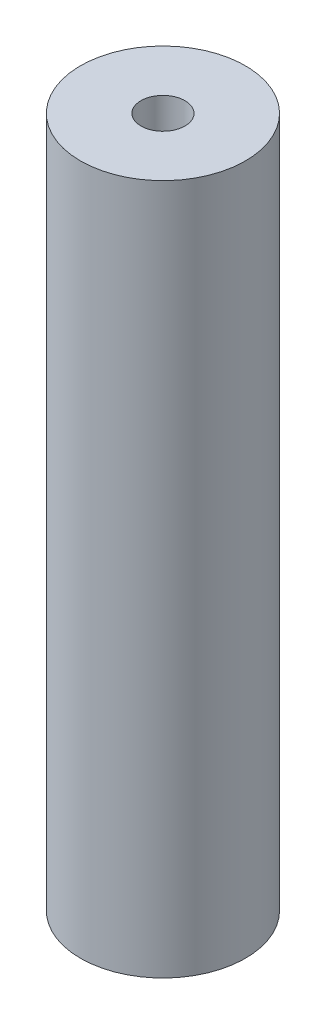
from build123d import *

# Parameters (mm, degrees)
SKETCH1_R           = 4.7625
BOSS_EXTRUDE1_DEPTH = 39.878
SKETCH2_R           = 1.27
CUT_EXTRUDE1_DEPTH  = 41.442770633


with BuildPart() as part:
    # Sketch1 → Boss-Extrude1 (new body)
    with BuildSketch(Plane(origin=(0, 0, 0), x_dir=(1, 0, 0), z_dir=(0, 1, 0))):
        with Locations(Location((0, 0, 0), (0, 0, 270))):
            Circle(SKETCH1_R)
    extrude(amount=BOSS_EXTRUDE1_DEPTH)

    # Sketch2 → Cut-Extrude1 (cut, through all)
    with BuildSketch(Plane(origin=(0, 39.878, 0), x_dir=(1, 0, 0), z_dir=(0, 1, 0))):
        with Locations(Location((0, 0, 0), (0, 0, 270))):
            Circle(SKETCH2_R)
    extrude(amount=-CUT_EXTRUDE1_DEPTH, mode=Mode.SUBTRACT)


solid = part.part
